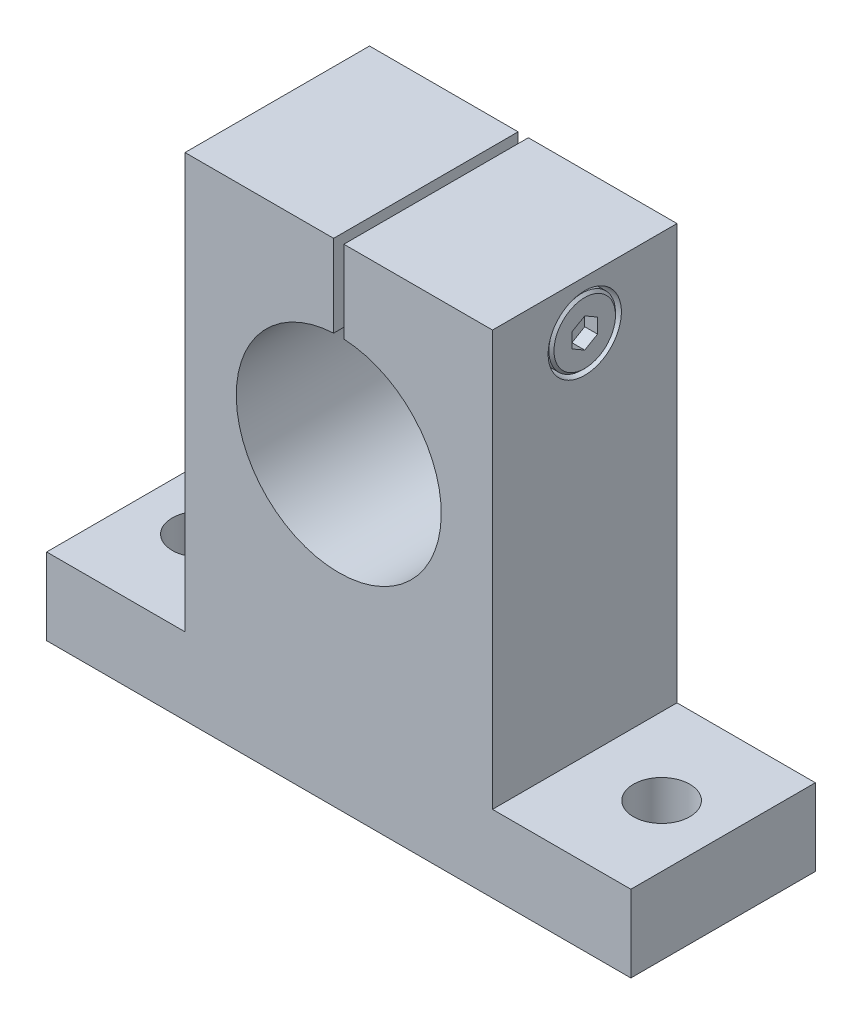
ISO-10303-21;
HEADER;
FILE_DESCRIPTION(('STEP AP214'),'2;1');
FILE_NAME('part.step','',(''),(''),'','','');
FILE_SCHEMA(('AUTOMOTIVE_DESIGN { 1 0 10303 214 1 1 1 1 }'));
ENDSEC;
DATA;
#1=APPLICATION_CONTEXT('core data for automotive mechanical design processes');
#2=APPLICATION_PROTOCOL_DEFINITION('international standard','automotive_design',2000,#1);
#3=PRODUCT_CONTEXT('',#1,'mechanical');
#4=PRODUCT('Part','Part','',(#3));
#5=PRODUCT_RELATED_PRODUCT_CATEGORY('part','',(#4));
#6=PRODUCT_DEFINITION_FORMATION('','',#4);
#7=PRODUCT_DEFINITION_CONTEXT('part definition',#1,'design');
#8=PRODUCT_DEFINITION('design','',#6,#7);
#9=PRODUCT_DEFINITION_SHAPE('','',#8);
#10=(LENGTH_UNIT() NAMED_UNIT(*) SI_UNIT(.MILLI.,.METRE.));
#11=(NAMED_UNIT(*) PLANE_ANGLE_UNIT() SI_UNIT($,.RADIAN.));
#12=(NAMED_UNIT(*) SI_UNIT($,.STERADIAN.) SOLID_ANGLE_UNIT());
#13=UNCERTAINTY_MEASURE_WITH_UNIT(LENGTH_MEASURE(1.E-05),#10,'distance_accuracy_value','');
#14=(GEOMETRIC_REPRESENTATION_CONTEXT(3) GLOBAL_UNCERTAINTY_ASSIGNED_CONTEXT((#13)) GLOBAL_UNIT_ASSIGNED_CONTEXT((#10,
#11,#12)) REPRESENTATION_CONTEXT('',''));
#15=CARTESIAN_POINT('',(0.,0.,0.));
#16=DIRECTION('',(0.,0.,1.));
#17=DIRECTION('',(1.,0.,0.));
#18=AXIS2_PLACEMENT_3D('',#15,#16,#17);
#19=CARTESIAN_POINT('',(0.,0.,-36.));
#20=DIRECTION('',(0.,0.,1.));
#21=DIRECTION('',(1.,0.,0.));
#22=AXIS2_PLACEMENT_3D('',#19,#20,#21);
#23=PLANE('',#22);
#24=DIRECTION('',(0.,1.,0.));
#25=VECTOR('',#24,1.);
#26=CARTESIAN_POINT('',(1.,0.,-36.));
#27=LINE('',#26,#25);
#28=CARTESIAN_POINT('',(1.,19.9749843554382,-36.));
#29=VERTEX_POINT('',#28);
#30=CARTESIAN_POINT('',(1.,36.,-36.));
#31=VERTEX_POINT('',#30);
#32=EDGE_CURVE('E236',#29,#31,#27,.T.);
#33=ORIENTED_EDGE('',*,*,#32,.T.);
#34=DIRECTION('',(-1.,0.,0.));
#35=VECTOR('',#34,1.);
#36=CARTESIAN_POINT('',(30.,36.,-36.));
#37=LINE('',#36,#35);
#38=CARTESIAN_POINT('',(30.,36.,-36.));
#39=VERTEX_POINT('',#38);
#40=EDGE_CURVE('E436',#39,#31,#37,.T.);
#41=ORIENTED_EDGE('',*,*,#40,.F.);
#42=DIRECTION('',(0.,1.,0.));
#43=VECTOR('',#42,1.);
#44=CARTESIAN_POINT('',(30.,-45.,-36.));
#45=LINE('',#44,#43);
#46=CARTESIAN_POINT('',(30.,-45.,-36.));
#47=VERTEX_POINT('',#46);
#48=EDGE_CURVE('E470',#47,#39,#45,.T.);
#49=ORIENTED_EDGE('',*,*,#48,.F.);
#50=DIRECTION('',(-1.,0.,0.));
#51=VECTOR('',#50,1.);
#52=CARTESIAN_POINT('',(57.,-45.,-36.));
#53=LINE('',#52,#51);
#54=CARTESIAN_POINT('',(57.,-45.,-36.));
#55=VERTEX_POINT('',#54);
#56=EDGE_CURVE('E462',#55,#47,#53,.T.);
#57=ORIENTED_EDGE('',*,*,#56,.F.);
#58=DIRECTION('',(0.,1.,0.));
#59=VECTOR('',#58,1.);
#60=CARTESIAN_POINT('',(57.,-60.,-36.));
#61=LINE('',#60,#59);
#62=CARTESIAN_POINT('',(57.,-60.,-36.));
#63=VERTEX_POINT('',#62);
#64=EDGE_CURVE('E450',#63,#55,#61,.T.);
#65=ORIENTED_EDGE('',*,*,#64,.F.);
#66=DIRECTION('',(1.,0.,0.));
#67=VECTOR('',#66,1.);
#68=CARTESIAN_POINT('',(-57.,-60.,-36.));
#69=LINE('',#68,#67);
#70=CARTESIAN_POINT('',(-57.,-60.,-36.));
#71=VERTEX_POINT('',#70);
#72=EDGE_CURVE('E10',#71,#63,#69,.T.);
#73=ORIENTED_EDGE('',*,*,#72,.F.);
#74=DIRECTION('',(0.,-1.,0.));
#75=VECTOR('',#74,1.);
#76=CARTESIAN_POINT('',(-57.,-45.,-36.));
#77=LINE('',#76,#75);
#78=CARTESIAN_POINT('',(-57.,-45.,-36.));
#79=VERTEX_POINT('',#78);
#80=EDGE_CURVE('E42',#79,#71,#77,.T.);
#81=ORIENTED_EDGE('',*,*,#80,.F.);
#82=DIRECTION('',(-1.,0.,0.));
#83=VECTOR('',#82,1.);
#84=CARTESIAN_POINT('',(-30.,-45.,-36.));
#85=LINE('',#84,#83);
#86=CARTESIAN_POINT('',(-30.,-45.,-36.));
#87=VERTEX_POINT('',#86);
#88=EDGE_CURVE('E475',#87,#79,#85,.T.);
#89=ORIENTED_EDGE('',*,*,#88,.F.);
#90=DIRECTION('',(0.,-1.,0.));
#91=VECTOR('',#90,1.);
#92=CARTESIAN_POINT('',(-30.,36.,-36.));
#93=LINE('',#92,#91);
#94=CARTESIAN_POINT('',(-30.,36.,-36.));
#95=VERTEX_POINT('',#94);
#96=EDGE_CURVE('E439',#95,#87,#93,.T.);
#97=ORIENTED_EDGE('',*,*,#96,.F.);
#98=DIRECTION('',(-1.,0.,0.));
#99=VECTOR('',#98,1.);
#100=CARTESIAN_POINT('',(30.,36.,-36.));
#101=LINE('',#100,#99);
#102=CARTESIAN_POINT('',(-1.,36.,-36.));
#103=VERTEX_POINT('',#102);
#104=EDGE_CURVE('E230',#103,#95,#101,.T.);
#105=ORIENTED_EDGE('',*,*,#104,.F.);
#106=DIRECTION('',(0.,-1.,0.));
#107=VECTOR('',#106,1.);
#108=CARTESIAN_POINT('',(-1.,18.,-36.));
#109=LINE('',#108,#107);
#110=CARTESIAN_POINT('',(-1.,19.9749843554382,-36.));
#111=VERTEX_POINT('',#110);
#112=EDGE_CURVE('E224',#103,#111,#109,.T.);
#113=ORIENTED_EDGE('',*,*,#112,.T.);
#114=CARTESIAN_POINT('',(0.,0.,-36.));
#115=DIRECTION('',(0.,0.,1.));
#116=DIRECTION('',(1.,0.,0.));
#117=AXIS2_PLACEMENT_3D('',#114,#115,#116);
#118=CIRCLE('',#117,20.);
#119=EDGE_CURVE('E228',#111,#29,#118,.T.);
#120=ORIENTED_EDGE('',*,*,#119,.T.);
#121=EDGE_LOOP('',(#33,#41,#49,#57,#65,#73,#81,#89,#97,#105,#113,#120));
#122=FACE_BOUND('',#121,.T.);
#123=ADVANCED_FACE('F16',(#122),#23,.F.);
#124=CARTESIAN_POINT('',(-57.,-60.,0.));
#125=DIRECTION('',(0.,-1.,0.));
#126=DIRECTION('',(0.,0.,-1.));
#127=AXIS2_PLACEMENT_3D('',#124,#125,#126);
#128=PLANE('',#127);
#129=CARTESIAN_POINT('',(45.,-60.,-18.));
#130=DIRECTION('',(0.,1.,0.));
#131=DIRECTION('',(0.,0.,-1.));
#132=AXIS2_PLACEMENT_3D('',#129,#130,#131);
#133=CIRCLE('',#132,5.5);
#134=CARTESIAN_POINT('',(45.,-60.,-12.5));
#135=VERTEX_POINT('',#134);
#136=EDGE_CURVE('E301',#135,#135,#133,.T.);
#137=ORIENTED_EDGE('',*,*,#136,.T.);
#138=EDGE_LOOP('',(#137));
#139=FACE_BOUND('',#138,.T.);
#140=CARTESIAN_POINT('',(-45.,-60.,-18.));
#141=DIRECTION('',(0.,1.,0.));
#142=DIRECTION('',(0.,0.,-1.));
#143=AXIS2_PLACEMENT_3D('',#140,#141,#142);
#144=CIRCLE('',#143,5.5);
#145=CARTESIAN_POINT('',(-45.,-60.,-12.5));
#146=VERTEX_POINT('',#145);
#147=EDGE_CURVE('E315',#146,#146,#144,.T.);
#148=ORIENTED_EDGE('',*,*,#147,.T.);
#149=EDGE_LOOP('',(#148));
#150=FACE_BOUND('',#149,.T.);
#151=ORIENTED_EDGE('',*,*,#72,.T.);
#152=DIRECTION('',(0.,0.,-1.));
#153=VECTOR('',#152,1.);
#154=CARTESIAN_POINT('',(57.,-60.,0.));
#155=LINE('',#154,#153);
#156=CARTESIAN_POINT('',(57.,-60.,0.));
#157=VERTEX_POINT('',#156);
#158=EDGE_CURVE('E458',#157,#63,#155,.T.);
#159=ORIENTED_EDGE('',*,*,#158,.F.);
#160=DIRECTION('',(1.,0.,0.));
#161=VECTOR('',#160,1.);
#162=CARTESIAN_POINT('',(-57.,-60.,0.));
#163=LINE('',#162,#161);
#164=CARTESIAN_POINT('',(-57.,-60.,0.));
#165=VERTEX_POINT('',#164);
#166=EDGE_CURVE('E319',#165,#157,#163,.T.);
#167=ORIENTED_EDGE('',*,*,#166,.F.);
#168=DIRECTION('',(0.,0.,-1.));
#169=VECTOR('',#168,1.);
#170=CARTESIAN_POINT('',(-57.,-60.,0.));
#171=LINE('',#170,#169);
#172=EDGE_CURVE('E19',#165,#71,#171,.T.);
#173=ORIENTED_EDGE('',*,*,#172,.T.);
#174=EDGE_LOOP('',(#151,#159,#167,#173));
#175=FACE_BOUND('',#174,.T.);
#176=ADVANCED_FACE('F499',(#139,#150,#175),#128,.T.);
#177=CARTESIAN_POINT('',(-57.,-45.,0.));
#178=DIRECTION('',(-1.,0.,0.));
#179=DIRECTION('',(0.,0.,1.));
#180=AXIS2_PLACEMENT_3D('',#177,#178,#179);
#181=PLANE('',#180);
#182=ORIENTED_EDGE('',*,*,#80,.T.);
#183=ORIENTED_EDGE('',*,*,#172,.F.);
#184=DIRECTION('',(0.,-1.,0.));
#185=VECTOR('',#184,1.);
#186=CARTESIAN_POINT('',(-57.,-45.,0.));
#187=LINE('',#186,#185);
#188=CARTESIAN_POINT('',(-57.,-45.,0.));
#189=VERTEX_POINT('',#188);
#190=EDGE_CURVE('E263',#189,#165,#187,.T.);
#191=ORIENTED_EDGE('',*,*,#190,.F.);
#192=DIRECTION('',(0.,0.,-1.));
#193=VECTOR('',#192,1.);
#194=CARTESIAN_POINT('',(-57.,-45.,0.));
#195=LINE('',#194,#193);
#196=EDGE_CURVE('E488',#189,#79,#195,.T.);
#197=ORIENTED_EDGE('',*,*,#196,.T.);
#198=EDGE_LOOP('',(#182,#183,#191,#197));
#199=FACE_BOUND('',#198,.T.);
#200=ADVANCED_FACE('F501',(#199),#181,.T.);
#201=CARTESIAN_POINT('',(-30.,-45.,0.));
#202=DIRECTION('',(0.,1.,0.));
#203=DIRECTION('',(1.,0.,0.));
#204=AXIS2_PLACEMENT_3D('',#201,#202,#203);
#205=PLANE('',#204);
#206=CARTESIAN_POINT('',(-45.,-45.,-18.));
#207=DIRECTION('',(0.,-1.,0.));
#208=DIRECTION('',(0.,0.,-1.));
#209=AXIS2_PLACEMENT_3D('',#206,#207,#208);
#210=CIRCLE('',#209,5.5);
#211=CARTESIAN_POINT('',(-45.,-45.,-12.5));
#212=VERTEX_POINT('',#211);
#213=EDGE_CURVE('E304',#212,#212,#210,.T.);
#214=ORIENTED_EDGE('',*,*,#213,.T.);
#215=EDGE_LOOP('',(#214));
#216=FACE_BOUND('',#215,.T.);
#217=ORIENTED_EDGE('',*,*,#88,.T.);
#218=ORIENTED_EDGE('',*,*,#196,.F.);
#219=DIRECTION('',(-1.,0.,0.));
#220=VECTOR('',#219,1.);
#221=CARTESIAN_POINT('',(-30.,-45.,0.));
#222=LINE('',#221,#220);
#223=CARTESIAN_POINT('',(-30.,-45.,0.));
#224=VERTEX_POINT('',#223);
#225=EDGE_CURVE('E259',#224,#189,#222,.T.);
#226=ORIENTED_EDGE('',*,*,#225,.F.);
#227=DIRECTION('',(0.,0.,-1.));
#228=VECTOR('',#227,1.);
#229=CARTESIAN_POINT('',(-30.,-45.,0.));
#230=LINE('',#229,#228);
#231=EDGE_CURVE('E471',#224,#87,#230,.T.);
#232=ORIENTED_EDGE('',*,*,#231,.T.);
#233=EDGE_LOOP('',(#217,#218,#226,#232));
#234=FACE_BOUND('',#233,.T.);
#235=ADVANCED_FACE('F507',(#216,#234),#205,.T.);
#236=CARTESIAN_POINT('',(-30.,36.,0.));
#237=DIRECTION('',(-1.,0.,0.));
#238=DIRECTION('',(0.,0.,1.));
#239=AXIS2_PLACEMENT_3D('',#236,#237,#238);
#240=PLANE('',#239);
#241=ORIENTED_EDGE('',*,*,#96,.T.);
#242=ORIENTED_EDGE('',*,*,#231,.F.);
#243=DIRECTION('',(0.,-1.,0.));
#244=VECTOR('',#243,1.);
#245=CARTESIAN_POINT('',(-30.,36.,0.));
#246=LINE('',#245,#244);
#247=CARTESIAN_POINT('',(-30.,36.,0.));
#248=VERTEX_POINT('',#247);
#249=EDGE_CURVE('E264',#248,#224,#246,.T.);
#250=ORIENTED_EDGE('',*,*,#249,.F.);
#251=DIRECTION('',(0.,0.,-1.));
#252=VECTOR('',#251,1.);
#253=CARTESIAN_POINT('',(-30.,36.,0.));
#254=LINE('',#253,#252);
#255=EDGE_CURVE('E446',#248,#95,#254,.T.);
#256=ORIENTED_EDGE('',*,*,#255,.T.);
#257=EDGE_LOOP('',(#241,#242,#250,#256));
#258=FACE_BOUND('',#257,.T.);
#259=ADVANCED_FACE('F509',(#258),#240,.T.);
#260=CARTESIAN_POINT('',(30.,36.,0.));
#261=DIRECTION('',(0.,1.,0.));
#262=DIRECTION('',(1.,0.,0.));
#263=AXIS2_PLACEMENT_3D('',#260,#261,#262);
#264=PLANE('',#263);
#265=DIRECTION('',(0.,0.,1.));
#266=VECTOR('',#265,1.);
#267=CARTESIAN_POINT('',(1.,36.,0.));
#268=LINE('',#267,#266);
#269=CARTESIAN_POINT('',(1.,36.,0.));
#270=VERTEX_POINT('',#269);
#271=EDGE_CURVE('E344',#31,#270,#268,.T.);
#272=ORIENTED_EDGE('',*,*,#271,.T.);
#273=DIRECTION('',(-1.,0.,0.));
#274=VECTOR('',#273,1.);
#275=CARTESIAN_POINT('',(30.,36.,0.));
#276=LINE('',#275,#274);
#277=CARTESIAN_POINT('',(30.,36.,0.));
#278=VERTEX_POINT('',#277);
#279=EDGE_CURVE('E405',#278,#270,#276,.T.);
#280=ORIENTED_EDGE('',*,*,#279,.F.);
#281=DIRECTION('',(0.,0.,-1.));
#282=VECTOR('',#281,1.);
#283=CARTESIAN_POINT('',(30.,36.,0.));
#284=LINE('',#283,#282);
#285=EDGE_CURVE('E440',#278,#39,#284,.T.);
#286=ORIENTED_EDGE('',*,*,#285,.T.);
#287=ORIENTED_EDGE('',*,*,#40,.T.);
#288=EDGE_LOOP('',(#272,#280,#286,#287));
#289=FACE_BOUND('',#288,.T.);
#290=ADVANCED_FACE('F518',(#289),#264,.T.);
#291=CARTESIAN_POINT('',(30.,-45.,0.));
#292=DIRECTION('',(1.,0.,0.));
#293=DIRECTION('',(0.,1.,0.));
#294=AXIS2_PLACEMENT_3D('',#291,#292,#293);
#295=PLANE('',#294);
#296=CARTESIAN_POINT('',(30.,26.5,-18.));
#297=DIRECTION('',(-1.,0.,0.));
#298=DIRECTION('',(0.,0.,-1.));
#299=AXIS2_PLACEMENT_3D('',#296,#297,#298);
#300=CIRCLE('',#299,7.15);
#301=CARTESIAN_POINT('',(30.,26.5,-10.85));
#302=VERTEX_POINT('',#301);
#303=EDGE_CURVE('E329',#302,#302,#300,.T.);
#304=ORIENTED_EDGE('',*,*,#303,.T.);
#305=EDGE_LOOP('',(#304));
#306=FACE_BOUND('',#305,.T.);
#307=ORIENTED_EDGE('',*,*,#48,.T.);
#308=ORIENTED_EDGE('',*,*,#285,.F.);
#309=DIRECTION('',(0.,1.,0.));
#310=VECTOR('',#309,1.);
#311=CARTESIAN_POINT('',(30.,-45.,0.));
#312=LINE('',#311,#310);
#313=CARTESIAN_POINT('',(30.,-45.,0.));
#314=VERTEX_POINT('',#313);
#315=EDGE_CURVE('E284',#314,#278,#312,.T.);
#316=ORIENTED_EDGE('',*,*,#315,.F.);
#317=DIRECTION('',(0.,0.,-1.));
#318=VECTOR('',#317,1.);
#319=CARTESIAN_POINT('',(30.,-45.,0.));
#320=LINE('',#319,#318);
#321=EDGE_CURVE('E465',#314,#47,#320,.T.);
#322=ORIENTED_EDGE('',*,*,#321,.T.);
#323=EDGE_LOOP('',(#307,#308,#316,#322));
#324=FACE_BOUND('',#323,.T.);
#325=ADVANCED_FACE('F521',(#306,#324),#295,.T.);
#326=CARTESIAN_POINT('',(57.,-45.,0.));
#327=DIRECTION('',(0.,1.,0.));
#328=DIRECTION('',(1.,0.,0.));
#329=AXIS2_PLACEMENT_3D('',#326,#327,#328);
#330=PLANE('',#329);
#331=CARTESIAN_POINT('',(45.,-45.,-18.));
#332=DIRECTION('',(0.,-1.,0.));
#333=DIRECTION('',(0.,0.,-1.));
#334=AXIS2_PLACEMENT_3D('',#331,#332,#333);
#335=CIRCLE('',#334,5.5);
#336=CARTESIAN_POINT('',(45.,-45.,-12.5));
#337=VERTEX_POINT('',#336);
#338=EDGE_CURVE('E296',#337,#337,#335,.T.);
#339=ORIENTED_EDGE('',*,*,#338,.T.);
#340=EDGE_LOOP('',(#339));
#341=FACE_BOUND('',#340,.T.);
#342=ORIENTED_EDGE('',*,*,#56,.T.);
#343=ORIENTED_EDGE('',*,*,#321,.F.);
#344=DIRECTION('',(-1.,0.,0.));
#345=VECTOR('',#344,1.);
#346=CARTESIAN_POINT('',(57.,-45.,0.));
#347=LINE('',#346,#345);
#348=CARTESIAN_POINT('',(57.,-45.,0.));
#349=VERTEX_POINT('',#348);
#350=EDGE_CURVE('E280',#349,#314,#347,.T.);
#351=ORIENTED_EDGE('',*,*,#350,.F.);
#352=DIRECTION('',(0.,0.,-1.));
#353=VECTOR('',#352,1.);
#354=CARTESIAN_POINT('',(57.,-45.,0.));
#355=LINE('',#354,#353);
#356=EDGE_CURVE('E454',#349,#55,#355,.T.);
#357=ORIENTED_EDGE('',*,*,#356,.T.);
#358=EDGE_LOOP('',(#342,#343,#351,#357));
#359=FACE_BOUND('',#358,.T.);
#360=ADVANCED_FACE('F524',(#341,#359),#330,.T.);
#361=CARTESIAN_POINT('',(57.,-60.,0.));
#362=DIRECTION('',(1.,0.,0.));
#363=DIRECTION('',(0.,1.,0.));
#364=AXIS2_PLACEMENT_3D('',#361,#362,#363);
#365=PLANE('',#364);
#366=ORIENTED_EDGE('',*,*,#64,.T.);
#367=ORIENTED_EDGE('',*,*,#356,.F.);
#368=DIRECTION('',(0.,1.,0.));
#369=VECTOR('',#368,1.);
#370=CARTESIAN_POINT('',(57.,-60.,0.));
#371=LINE('',#370,#369);
#372=EDGE_CURVE('E285',#157,#349,#371,.T.);
#373=ORIENTED_EDGE('',*,*,#372,.F.);
#374=ORIENTED_EDGE('',*,*,#158,.T.);
#375=EDGE_LOOP('',(#366,#367,#373,#374));
#376=FACE_BOUND('',#375,.T.);
#377=ADVANCED_FACE('F526',(#376),#365,.T.);
#378=CARTESIAN_POINT('',(30.,36.,0.));
#379=DIRECTION('',(0.,1.,0.));
#380=DIRECTION('',(1.,0.,0.));
#381=AXIS2_PLACEMENT_3D('',#378,#379,#380);
#382=PLANE('',#381);
#383=DIRECTION('',(0.,0.,-1.));
#384=VECTOR('',#383,1.);
#385=CARTESIAN_POINT('',(-1.,36.,0.));
#386=LINE('',#385,#384);
#387=CARTESIAN_POINT('',(-1.,36.,0.));
#388=VERTEX_POINT('',#387);
#389=EDGE_CURVE('E235',#388,#103,#386,.T.);
#390=ORIENTED_EDGE('',*,*,#389,.T.);
#391=ORIENTED_EDGE('',*,*,#104,.T.);
#392=ORIENTED_EDGE('',*,*,#255,.F.);
#393=DIRECTION('',(-1.,0.,0.));
#394=VECTOR('',#393,1.);
#395=CARTESIAN_POINT('',(30.,36.,0.));
#396=LINE('',#395,#394);
#397=EDGE_CURVE('E423',#388,#248,#396,.T.);
#398=ORIENTED_EDGE('',*,*,#397,.F.);
#399=EDGE_LOOP('',(#390,#391,#392,#398));
#400=FACE_BOUND('',#399,.T.);
#401=ADVANCED_FACE('F511',(#400),#382,.T.);
#402=CARTESIAN_POINT('',(0.,0.,0.));
#403=DIRECTION('',(0.,0.,1.));
#404=DIRECTION('',(1.,0.,0.));
#405=AXIS2_PLACEMENT_3D('',#402,#403,#404);
#406=PLANE('',#405);
#407=DIRECTION('',(0.,-1.,0.));
#408=VECTOR('',#407,1.);
#409=CARTESIAN_POINT('',(1.,0.,0.));
#410=LINE('',#409,#408);
#411=CARTESIAN_POINT('',(1.,19.9749843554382,0.));
#412=VERTEX_POINT('',#411);
#413=EDGE_CURVE('E348',#270,#412,#410,.T.);
#414=ORIENTED_EDGE('',*,*,#413,.T.);
#415=CARTESIAN_POINT('',(0.,0.,0.));
#416=DIRECTION('',(0.,0.,-1.));
#417=DIRECTION('',(1.,0.,0.));
#418=AXIS2_PLACEMENT_3D('',#415,#416,#417);
#419=CIRCLE('',#418,20.);
#420=CARTESIAN_POINT('',(-1.,19.9749843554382,0.));
#421=VERTEX_POINT('',#420);
#422=EDGE_CURVE('E247',#412,#421,#419,.T.);
#423=ORIENTED_EDGE('',*,*,#422,.T.);
#424=DIRECTION('',(0.,1.,0.));
#425=VECTOR('',#424,1.);
#426=CARTESIAN_POINT('',(-1.,18.,0.));
#427=LINE('',#426,#425);
#428=EDGE_CURVE('E242',#421,#388,#427,.T.);
#429=ORIENTED_EDGE('',*,*,#428,.T.);
#430=ORIENTED_EDGE('',*,*,#397,.T.);
#431=ORIENTED_EDGE('',*,*,#249,.T.);
#432=ORIENTED_EDGE('',*,*,#225,.T.);
#433=ORIENTED_EDGE('',*,*,#190,.T.);
#434=ORIENTED_EDGE('',*,*,#166,.T.);
#435=ORIENTED_EDGE('',*,*,#372,.T.);
#436=ORIENTED_EDGE('',*,*,#350,.T.);
#437=ORIENTED_EDGE('',*,*,#315,.T.);
#438=ORIENTED_EDGE('',*,*,#279,.T.);
#439=EDGE_LOOP('',(#414,#423,#429,#430,#431,#432,#433,#434,#435,#436,#437,#438));
#440=FACE_BOUND('',#439,.T.);
#441=ADVANCED_FACE('F504',(#440),#406,.T.);
#442=CARTESIAN_POINT('',(-1.,36.,0.));
#443=DIRECTION('',(-1.,0.,0.));
#444=DIRECTION('',(0.,0.,1.));
#445=AXIS2_PLACEMENT_3D('',#442,#443,#444);
#446=PLANE('',#445);
#447=CARTESIAN_POINT('',(-1.,26.5,-18.));
#448=DIRECTION('',(-1.,0.,0.));
#449=DIRECTION('',(0.,1.,0.));
#450=AXIS2_PLACEMENT_3D('',#447,#448,#449);
#451=CIRCLE('',#450,4.);
#452=CARTESIAN_POINT('',(-1.,22.5,-18.));
#453=VERTEX_POINT('',#452);
#454=EDGE_CURVE('E270',#453,#453,#451,.T.);
#455=ORIENTED_EDGE('',*,*,#454,.T.);
#456=EDGE_LOOP('',(#455));
#457=FACE_BOUND('',#456,.T.);
#458=DIRECTION('',(0.,0.,1.));
#459=VECTOR('',#458,1.);
#460=CARTESIAN_POINT('',(-1.,19.9749843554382,-18.));
#461=LINE('',#460,#459);
#462=EDGE_CURVE('E239',#111,#421,#461,.T.);
#463=ORIENTED_EDGE('',*,*,#462,.F.);
#464=ORIENTED_EDGE('',*,*,#112,.F.);
#465=ORIENTED_EDGE('',*,*,#389,.F.);
#466=ORIENTED_EDGE('',*,*,#428,.F.);
#467=EDGE_LOOP('',(#463,#464,#465,#466));
#468=FACE_BOUND('',#467,.T.);
#469=ADVANCED_FACE('F240',(#457,#468),#446,.F.);
#470=CARTESIAN_POINT('',(1.,0.,0.));
#471=DIRECTION('',(1.,0.,0.));
#472=DIRECTION('',(0.,1.,0.));
#473=AXIS2_PLACEMENT_3D('',#470,#471,#472);
#474=PLANE('',#473);
#475=CARTESIAN_POINT('',(1.,26.5,-18.));
#476=DIRECTION('',(1.,0.,0.));
#477=DIRECTION('',(0.,1.,0.));
#478=AXIS2_PLACEMENT_3D('',#475,#476,#477);
#479=CIRCLE('',#478,4.);
#480=CARTESIAN_POINT('',(1.,22.5,-18.));
#481=VERTEX_POINT('',#480);
#482=EDGE_CURVE('E318',#481,#481,#479,.T.);
#483=ORIENTED_EDGE('',*,*,#482,.T.);
#484=EDGE_LOOP('',(#483));
#485=FACE_BOUND('',#484,.T.);
#486=DIRECTION('',(0.,0.,-1.));
#487=VECTOR('',#486,1.);
#488=CARTESIAN_POINT('',(1.,19.9749843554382,-18.));
#489=LINE('',#488,#487);
#490=EDGE_CURVE('E252',#412,#29,#489,.T.);
#491=ORIENTED_EDGE('',*,*,#490,.F.);
#492=ORIENTED_EDGE('',*,*,#413,.F.);
#493=ORIENTED_EDGE('',*,*,#271,.F.);
#494=ORIENTED_EDGE('',*,*,#32,.F.);
#495=EDGE_LOOP('',(#491,#492,#493,#494));
#496=FACE_BOUND('',#495,.T.);
#497=ADVANCED_FACE('F516',(#485,#496),#474,.F.);
#498=CARTESIAN_POINT('',(25.,0.,0.));
#499=DIRECTION('',(1.,0.,0.));
#500=DIRECTION('',(0.,1.,0.));
#501=AXIS2_PLACEMENT_3D('',#498,#499,#500);
#502=PLANE('',#501);
#503=CARTESIAN_POINT('',(25.,26.5,-18.));
#504=DIRECTION('',(-1.,0.,0.));
#505=DIRECTION('',(0.,1.,0.));
#506=AXIS2_PLACEMENT_3D('',#503,#504,#505);
#507=CIRCLE('',#506,6.5);
#508=CARTESIAN_POINT('',(25.,20.,-18.));
#509=VERTEX_POINT('',#508);
#510=EDGE_CURVE('E343',#509,#509,#507,.T.);
#511=ORIENTED_EDGE('',*,*,#510,.T.);
#512=EDGE_LOOP('',(#511));
#513=FACE_BOUND('',#512,.T.);
#514=CARTESIAN_POINT('',(25.,26.5,-18.));
#515=DIRECTION('',(1.,0.,0.));
#516=DIRECTION('',(0.,0.,-1.));
#517=AXIS2_PLACEMENT_3D('',#514,#515,#516);
#518=CIRCLE('',#517,7.15);
#519=CARTESIAN_POINT('',(25.,26.5,-10.85));
#520=VERTEX_POINT('',#519);
#521=EDGE_CURVE('E265',#520,#520,#518,.T.);
#522=ORIENTED_EDGE('',*,*,#521,.T.);
#523=EDGE_LOOP('',(#522));
#524=FACE_BOUND('',#523,.T.);
#525=ADVANCED_FACE('F565',(#513,#524),#502,.T.);
#526=CARTESIAN_POINT('',(30.,29.5,-18.));
#527=DIRECTION('',(1.,0.,0.));
#528=DIRECTION('',(0.,1.,0.));
#529=AXIS2_PLACEMENT_3D('',#526,#527,#528);
#530=PLANE('',#529);
#531=DIRECTION('',(0.,0.5,0.866025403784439));
#532=VECTOR('',#531,1.);
#533=CARTESIAN_POINT('',(30.,25.0707804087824,-15.4754809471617));
#534=LINE('',#533,#532);
#535=CARTESIAN_POINT('',(30.,23.6132486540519,-18.));
#536=VERTEX_POINT('',#535);
#537=CARTESIAN_POINT('',(30.,25.0566243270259,-15.5));
#538=VERTEX_POINT('',#537);
#539=EDGE_CURVE('E372',#536,#538,#534,.T.);
#540=ORIENTED_EDGE('',*,*,#539,.T.);
#541=DIRECTION('',(0.,1.,0.));
#542=VECTOR('',#541,1.);
#543=CARTESIAN_POINT('',(30.,28.721687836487,-15.5));
#544=LINE('',#543,#542);
#545=CARTESIAN_POINT('',(30.,27.9433756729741,-15.5));
#546=VERTEX_POINT('',#545);
#547=EDGE_CURVE('E398',#538,#546,#544,.T.);
#548=ORIENTED_EDGE('',*,*,#547,.T.);
#549=DIRECTION('',(0.,0.5,-0.866025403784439));
#550=VECTOR('',#549,1.);
#551=CARTESIAN_POINT('',(30.,29.4009074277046,-18.0245190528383));
#552=LINE('',#551,#550);
#553=CARTESIAN_POINT('',(30.,29.3867513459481,-18.));
#554=VERTEX_POINT('',#553);
#555=EDGE_CURVE('E380',#546,#554,#552,.T.);
#556=ORIENTED_EDGE('',*,*,#555,.T.);
#557=DIRECTION('',(0.,-0.5,-0.866025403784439));
#558=VECTOR('',#557,1.);
#559=CARTESIAN_POINT('',(30.,28.6792195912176,-19.2254809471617));
#560=LINE('',#559,#558);
#561=CARTESIAN_POINT('',(30.,27.9433756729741,-20.5));
#562=VERTEX_POINT('',#561);
#563=EDGE_CURVE('E291',#554,#562,#560,.T.);
#564=ORIENTED_EDGE('',*,*,#563,.T.);
#565=DIRECTION('',(0.,-1.,0.));
#566=VECTOR('',#565,1.);
#567=CARTESIAN_POINT('',(30.,27.278312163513,-20.5));
#568=LINE('',#567,#566);
#569=CARTESIAN_POINT('',(30.,25.0566243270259,-20.5));
#570=VERTEX_POINT('',#569);
#571=EDGE_CURVE('E357',#562,#570,#568,.T.);
#572=ORIENTED_EDGE('',*,*,#571,.T.);
#573=DIRECTION('',(0.,-0.5,0.866025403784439));
#574=VECTOR('',#573,1.);
#575=CARTESIAN_POINT('',(30.,24.3490925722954,-19.2745190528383));
#576=LINE('',#575,#574);
#577=EDGE_CURVE('E278',#570,#536,#576,.T.);
#578=ORIENTED_EDGE('',*,*,#577,.T.);
#579=EDGE_LOOP('',(#540,#548,#556,#564,#572,#578));
#580=FACE_BOUND('',#579,.T.);
#581=CARTESIAN_POINT('',(30.,26.5,-18.));
#582=DIRECTION('',(-1.,0.,0.));
#583=DIRECTION('',(0.,1.,0.));
#584=AXIS2_PLACEMENT_3D('',#581,#582,#583);
#585=CIRCLE('',#584,6.);
#586=CARTESIAN_POINT('',(30.,20.5,-18.));
#587=VERTEX_POINT('',#586);
#588=EDGE_CURVE('E361',#587,#587,#585,.T.);
#589=ORIENTED_EDGE('',*,*,#588,.F.);
#590=EDGE_LOOP('',(#589));
#591=FACE_BOUND('',#590,.T.);
#592=ADVANCED_FACE('F567',(#580,#591),#530,.T.);
#593=CARTESIAN_POINT('',(27.5,0.,0.));
#594=DIRECTION('',(1.,0.,0.));
#595=DIRECTION('',(0.,1.,0.));
#596=AXIS2_PLACEMENT_3D('',#593,#594,#595);
#597=PLANE('',#596);
#598=DIRECTION('',(0.,-0.5,-0.866025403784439));
#599=VECTOR('',#598,1.);
#600=CARTESIAN_POINT('',(27.5,25.0566243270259,-15.5));
#601=LINE('',#600,#599);
#602=CARTESIAN_POINT('',(27.5,25.0566243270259,-15.5));
#603=VERTEX_POINT('',#602);
#604=CARTESIAN_POINT('',(27.5,23.6132486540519,-18.));
#605=VERTEX_POINT('',#604);
#606=EDGE_CURVE('E364',#603,#605,#601,.T.);
#607=ORIENTED_EDGE('',*,*,#606,.T.);
#608=DIRECTION('',(0.,0.5,-0.866025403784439));
#609=VECTOR('',#608,1.);
#610=CARTESIAN_POINT('',(27.5,23.6132486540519,-18.));
#611=LINE('',#610,#609);
#612=CARTESIAN_POINT('',(27.5,25.0566243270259,-20.5));
#613=VERTEX_POINT('',#612);
#614=EDGE_CURVE('E384',#605,#613,#611,.T.);
#615=ORIENTED_EDGE('',*,*,#614,.T.);
#616=DIRECTION('',(0.,1.,0.));
#617=VECTOR('',#616,1.);
#618=CARTESIAN_POINT('',(27.5,25.0566243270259,-20.5));
#619=LINE('',#618,#617);
#620=CARTESIAN_POINT('',(27.5,27.9433756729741,-20.5));
#621=VERTEX_POINT('',#620);
#622=EDGE_CURVE('E277',#613,#621,#619,.T.);
#623=ORIENTED_EDGE('',*,*,#622,.T.);
#624=DIRECTION('',(0.,0.5,0.866025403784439));
#625=VECTOR('',#624,1.);
#626=CARTESIAN_POINT('',(27.5,27.9433756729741,-20.5));
#627=LINE('',#626,#625);
#628=CARTESIAN_POINT('',(27.5,29.3867513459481,-18.));
#629=VERTEX_POINT('',#628);
#630=EDGE_CURVE('E356',#621,#629,#627,.T.);
#631=ORIENTED_EDGE('',*,*,#630,.T.);
#632=DIRECTION('',(0.,-0.5,0.866025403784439));
#633=VECTOR('',#632,1.);
#634=CARTESIAN_POINT('',(27.5,29.3867513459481,-18.));
#635=LINE('',#634,#633);
#636=CARTESIAN_POINT('',(27.5,27.9433756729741,-15.5));
#637=VERTEX_POINT('',#636);
#638=EDGE_CURVE('E290',#629,#637,#635,.T.);
#639=ORIENTED_EDGE('',*,*,#638,.T.);
#640=DIRECTION('',(0.,-1.,0.));
#641=VECTOR('',#640,1.);
#642=CARTESIAN_POINT('',(27.5,27.9433756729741,-15.5));
#643=LINE('',#642,#641);
#644=EDGE_CURVE('E395',#637,#603,#643,.T.);
#645=ORIENTED_EDGE('',*,*,#644,.T.);
#646=EDGE_LOOP('',(#607,#615,#623,#631,#639,#645));
#647=FACE_BOUND('',#646,.T.);
#648=ADVANCED_FACE('F574',(#647),#597,.T.);
#649=CARTESIAN_POINT('',(30.,27.9433756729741,-15.5));
#650=DIRECTION('',(0.,0.,1.));
#651=DIRECTION('',(1.,0.,0.));
#652=AXIS2_PLACEMENT_3D('',#649,#650,#651);
#653=PLANE('',#652);
#654=ORIENTED_EDGE('',*,*,#644,.F.);
#655=DIRECTION('',(-1.,0.,0.));
#656=VECTOR('',#655,1.);
#657=CARTESIAN_POINT('',(30.,27.9433756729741,-15.5));
#658=LINE('',#657,#656);
#659=EDGE_CURVE('E399',#546,#637,#658,.T.);
#660=ORIENTED_EDGE('',*,*,#659,.F.);
#661=ORIENTED_EDGE('',*,*,#547,.F.);
#662=DIRECTION('',(-1.,0.,0.));
#663=VECTOR('',#662,1.);
#664=CARTESIAN_POINT('',(30.,25.0566243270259,-15.5));
#665=LINE('',#664,#663);
#666=EDGE_CURVE('E368',#538,#603,#665,.T.);
#667=ORIENTED_EDGE('',*,*,#666,.T.);
#668=EDGE_LOOP('',(#654,#660,#661,#667));
#669=FACE_BOUND('',#668,.T.);
#670=ADVANCED_FACE('F617',(#669),#653,.F.);
#671=CARTESIAN_POINT('',(30.,29.3867513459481,-18.));
#672=DIRECTION('',(0.,0.866025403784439,0.5));
#673=DIRECTION('',(1.,0.,0.));
#674=AXIS2_PLACEMENT_3D('',#671,#672,#673);
#675=PLANE('',#674);
#676=ORIENTED_EDGE('',*,*,#638,.F.);
#677=DIRECTION('',(-1.,0.,0.));
#678=VECTOR('',#677,1.);
#679=CARTESIAN_POINT('',(30.,29.3867513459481,-18.));
#680=LINE('',#679,#678);
#681=EDGE_CURVE('E286',#554,#629,#680,.T.);
#682=ORIENTED_EDGE('',*,*,#681,.F.);
#683=ORIENTED_EDGE('',*,*,#555,.F.);
#684=ORIENTED_EDGE('',*,*,#659,.T.);
#685=EDGE_LOOP('',(#676,#682,#683,#684));
#686=FACE_BOUND('',#685,.T.);
#687=ADVANCED_FACE('F613',(#686),#675,.F.);
#688=CARTESIAN_POINT('',(30.,27.9433756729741,-20.5));
#689=DIRECTION('',(0.,0.866025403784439,-0.5));
#690=DIRECTION('',(-1.,0.,0.));
#691=AXIS2_PLACEMENT_3D('',#688,#689,#690);
#692=PLANE('',#691);
#693=ORIENTED_EDGE('',*,*,#630,.F.);
#694=DIRECTION('',(-1.,0.,0.));
#695=VECTOR('',#694,1.);
#696=CARTESIAN_POINT('',(30.,27.9433756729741,-20.5));
#697=LINE('',#696,#695);
#698=EDGE_CURVE('E352',#562,#621,#697,.T.);
#699=ORIENTED_EDGE('',*,*,#698,.F.);
#700=ORIENTED_EDGE('',*,*,#563,.F.);
#701=ORIENTED_EDGE('',*,*,#681,.T.);
#702=EDGE_LOOP('',(#693,#699,#700,#701));
#703=FACE_BOUND('',#702,.T.);
#704=ADVANCED_FACE('F616',(#703),#692,.F.);
#705=CARTESIAN_POINT('',(30.,25.0566243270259,-20.5));
#706=DIRECTION('',(0.,0.,-1.));
#707=DIRECTION('',(0.,-1.,0.));
#708=AXIS2_PLACEMENT_3D('',#705,#706,#707);
#709=PLANE('',#708);
#710=ORIENTED_EDGE('',*,*,#622,.F.);
#711=DIRECTION('',(-1.,0.,0.));
#712=VECTOR('',#711,1.);
#713=CARTESIAN_POINT('',(30.,25.0566243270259,-20.5));
#714=LINE('',#713,#712);
#715=EDGE_CURVE('E274',#570,#613,#714,.T.);
#716=ORIENTED_EDGE('',*,*,#715,.F.);
#717=ORIENTED_EDGE('',*,*,#571,.F.);
#718=ORIENTED_EDGE('',*,*,#698,.T.);
#719=EDGE_LOOP('',(#710,#716,#717,#718));
#720=FACE_BOUND('',#719,.T.);
#721=ADVANCED_FACE('F624',(#720),#709,.F.);
#722=CARTESIAN_POINT('',(30.,23.6132486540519,-18.));
#723=DIRECTION('',(0.,-0.866025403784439,-0.5));
#724=DIRECTION('',(0.,0.5,-0.866025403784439));
#725=AXIS2_PLACEMENT_3D('',#722,#723,#724);
#726=PLANE('',#725);
#727=ORIENTED_EDGE('',*,*,#614,.F.);
#728=DIRECTION('',(-1.,0.,0.));
#729=VECTOR('',#728,1.);
#730=CARTESIAN_POINT('',(30.,23.6132486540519,-18.));
#731=LINE('',#730,#729);
#732=EDGE_CURVE('E376',#536,#605,#731,.T.);
#733=ORIENTED_EDGE('',*,*,#732,.F.);
#734=ORIENTED_EDGE('',*,*,#577,.F.);
#735=ORIENTED_EDGE('',*,*,#715,.T.);
#736=EDGE_LOOP('',(#727,#733,#734,#735));
#737=FACE_BOUND('',#736,.T.);
#738=ADVANCED_FACE('F621',(#737),#726,.F.);
#739=CARTESIAN_POINT('',(30.,25.0566243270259,-15.5));
#740=DIRECTION('',(0.,-0.866025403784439,0.5));
#741=DIRECTION('',(-1.,0.,0.));
#742=AXIS2_PLACEMENT_3D('',#739,#740,#741);
#743=PLANE('',#742);
#744=ORIENTED_EDGE('',*,*,#606,.F.);
#745=ORIENTED_EDGE('',*,*,#666,.F.);
#746=ORIENTED_EDGE('',*,*,#539,.F.);
#747=ORIENTED_EDGE('',*,*,#732,.T.);
#748=EDGE_LOOP('',(#744,#745,#746,#747));
#749=FACE_BOUND('',#748,.T.);
#750=ADVANCED_FACE('F607',(#749),#743,.F.);
#751=CARTESIAN_POINT('',(29.75,26.5,-18.));
#752=DIRECTION('',(-1.,0.,0.));
#753=DIRECTION('',(0.,1.,0.));
#754=AXIS2_PLACEMENT_3D('',#751,#752,#753);
#755=CONICAL_SURFACE('',#754,6.25,0.785398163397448);
#756=CARTESIAN_POINT('',(29.5,26.5,-18.));
#757=DIRECTION('',(-1.,0.,0.));
#758=DIRECTION('',(0.,1.,0.));
#759=AXIS2_PLACEMENT_3D('',#756,#757,#758);
#760=CIRCLE('',#759,6.5);
#761=CARTESIAN_POINT('',(29.5,20.,-18.));
#762=VERTEX_POINT('',#761);
#763=EDGE_CURVE('E335',#762,#762,#760,.T.);
#764=ORIENTED_EDGE('',*,*,#763,.F.);
#765=DIRECTION('',(0.707106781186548,0.707106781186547,0.));
#766=VECTOR('',#765,1.);
#767=CARTESIAN_POINT('',(29.75,20.25,-18.));
#768=LINE('',#767,#766);
#769=EDGE_CURVE('E351',#762,#587,#768,.T.);
#770=ORIENTED_EDGE('',*,*,#769,.T.);
#771=ORIENTED_EDGE('',*,*,#588,.T.);
#772=ORIENTED_EDGE('',*,*,#769,.F.);
#773=EDGE_LOOP('',(#764,#770,#771,#772));
#774=FACE_BOUND('',#773,.T.);
#775=ADVANCED_FACE('F605',(#774),#755,.T.);
#776=CARTESIAN_POINT('',(27.25,26.5,-18.));
#777=DIRECTION('',(1.,0.,0.));
#778=DIRECTION('',(0.,1.,0.));
#779=AXIS2_PLACEMENT_3D('',#776,#777,#778);
#780=CYLINDRICAL_SURFACE('',#779,6.5);
#781=ORIENTED_EDGE('',*,*,#763,.T.);
#782=DIRECTION('',(-1.,0.,0.));
#783=VECTOR('',#782,1.);
#784=CARTESIAN_POINT('',(27.25,20.,-18.));
#785=LINE('',#784,#783);
#786=EDGE_CURVE('E339',#762,#509,#785,.T.);
#787=ORIENTED_EDGE('',*,*,#786,.T.);
#788=ORIENTED_EDGE('',*,*,#510,.F.);
#789=ORIENTED_EDGE('',*,*,#786,.F.);
#790=EDGE_LOOP('',(#781,#787,#788,#789));
#791=FACE_BOUND('',#790,.T.);
#792=ADVANCED_FACE('F601',(#791),#780,.T.);
#793=CARTESIAN_POINT('',(30.,26.5,-18.));
#794=DIRECTION('',(1.,0.,0.));
#795=DIRECTION('',(0.,0.,-1.));
#796=AXIS2_PLACEMENT_3D('',#793,#794,#795);
#797=CYLINDRICAL_SURFACE('',#796,7.15);
#798=ORIENTED_EDGE('',*,*,#521,.F.);
#799=DIRECTION('',(1.,0.,0.));
#800=VECTOR('',#799,1.);
#801=CARTESIAN_POINT('',(30.,26.5,-10.85));
#802=LINE('',#801,#800);
#803=EDGE_CURVE('E269',#520,#302,#802,.T.);
#804=ORIENTED_EDGE('',*,*,#803,.T.);
#805=ORIENTED_EDGE('',*,*,#303,.F.);
#806=ORIENTED_EDGE('',*,*,#803,.F.);
#807=EDGE_LOOP('',(#798,#804,#805,#806));
#808=FACE_BOUND('',#807,.T.);
#809=ADVANCED_FACE('F563',(#808),#797,.F.);
#810=CARTESIAN_POINT('',(0.,26.5,-18.));
#811=DIRECTION('',(1.,0.,0.));
#812=DIRECTION('',(0.,1.,0.));
#813=AXIS2_PLACEMENT_3D('',#810,#811,#812);
#814=CYLINDRICAL_SURFACE('',#813,4.);
#815=ORIENTED_EDGE('',*,*,#482,.F.);
#816=DIRECTION('',(-1.,0.,0.));
#817=VECTOR('',#816,1.);
#818=CARTESIAN_POINT('',(0.,22.5,-18.));
#819=LINE('',#818,#817);
#820=EDGE_CURVE('E273',#481,#453,#819,.T.);
#821=ORIENTED_EDGE('',*,*,#820,.T.);
#822=ORIENTED_EDGE('',*,*,#454,.F.);
#823=ORIENTED_EDGE('',*,*,#820,.F.);
#824=EDGE_LOOP('',(#815,#821,#822,#823));
#825=FACE_BOUND('',#824,.T.);
#826=ADVANCED_FACE('F590',(#825),#814,.T.);
#827=CARTESIAN_POINT('',(-45.,-52.5,-18.));
#828=DIRECTION('',(0.,-1.,0.));
#829=DIRECTION('',(0.,0.,-1.));
#830=AXIS2_PLACEMENT_3D('',#827,#828,#829);
#831=CYLINDRICAL_SURFACE('',#830,5.5);
#832=ORIENTED_EDGE('',*,*,#213,.F.);
#833=DIRECTION('',(0.,-1.,0.));
#834=VECTOR('',#833,1.);
#835=CARTESIAN_POINT('',(-45.,-52.5,-12.5));
#836=LINE('',#835,#834);
#837=EDGE_CURVE('E308',#212,#146,#836,.T.);
#838=ORIENTED_EDGE('',*,*,#837,.T.);
#839=ORIENTED_EDGE('',*,*,#147,.F.);
#840=ORIENTED_EDGE('',*,*,#837,.F.);
#841=EDGE_LOOP('',(#832,#838,#839,#840));
#842=FACE_BOUND('',#841,.T.);
#843=ADVANCED_FACE('F592',(#842),#831,.F.);
#844=CARTESIAN_POINT('',(45.,-52.5,-18.));
#845=DIRECTION('',(0.,-1.,0.));
#846=DIRECTION('',(0.,0.,-1.));
#847=AXIS2_PLACEMENT_3D('',#844,#845,#846);
#848=CYLINDRICAL_SURFACE('',#847,5.5);
#849=ORIENTED_EDGE('',*,*,#338,.F.);
#850=DIRECTION('',(0.,-1.,0.));
#851=VECTOR('',#850,1.);
#852=CARTESIAN_POINT('',(45.,-52.5,-12.5));
#853=LINE('',#852,#851);
#854=EDGE_CURVE('E300',#337,#135,#853,.T.);
#855=ORIENTED_EDGE('',*,*,#854,.T.);
#856=ORIENTED_EDGE('',*,*,#136,.F.);
#857=ORIENTED_EDGE('',*,*,#854,.F.);
#858=EDGE_LOOP('',(#849,#855,#856,#857));
#859=FACE_BOUND('',#858,.T.);
#860=ADVANCED_FACE('F598',(#859),#848,.F.);
#861=CARTESIAN_POINT('',(0.,0.,0.));
#862=DIRECTION('',(0.,0.,1.));
#863=DIRECTION('',(0.,-1.,0.));
#864=AXIS2_PLACEMENT_3D('',#861,#862,#863);
#865=CYLINDRICAL_SURFACE('',#864,20.);
#866=ORIENTED_EDGE('',*,*,#119,.F.);
#867=ORIENTED_EDGE('',*,*,#462,.T.);
#868=ORIENTED_EDGE('',*,*,#422,.F.);
#869=ORIENTED_EDGE('',*,*,#490,.T.);
#870=EDGE_LOOP('',(#866,#867,#868,#869));
#871=FACE_BOUND('',#870,.T.);
#872=ADVANCED_FACE('F250',(#871),#865,.F.);
#873=CLOSED_SHELL('',(#123,#176,#200,#235,#259,#290,#325,#360,#377,#401,#441,#469,#497,#525,
#592,#648,#670,#687,#704,#721,#738,#750,#775,#792,#809,#826,#843,#860,#872));
#874=MANIFOLD_SOLID_BREP('B1',#873);
#875=ADVANCED_BREP_SHAPE_REPRESENTATION('',(#18,#874),#14);
#876=SHAPE_DEFINITION_REPRESENTATION(#9,#875);
ENDSEC;
END-ISO-10303-21;
